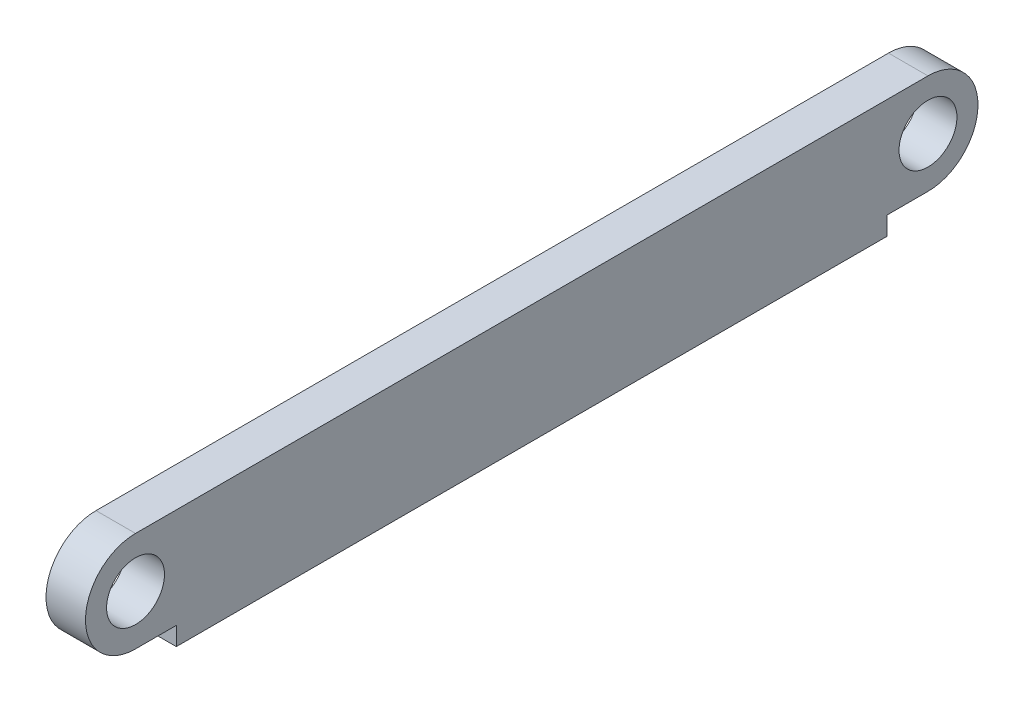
from build123d import *

# Parameters (mm, degrees)
SKETCH2_W           = 54
SKETCH2_H           = 9
BOSS_EXTRUDE1_DEPTH = 3
BOSS_EXTRUDE2_DEPTH = 3
SKETCH4_R           = 2.2
CUT_EXTRUDE1_DEPTH  = 43.860354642
SKETCH5_W           = 52
SKETCH5_H           = 7.5
CUT_EXTRUDE2_DEPTH  = 0.75


with BuildPart() as part:
    # Sketch2 → Boss-Extrude1 (new body)
    with BuildSketch(Plane(origin=(0, 0, 0), x_dir=(0, 0, -1), z_dir=(1, 0, 0))):
        with Locations((8.5, -1)):
            Rectangle(SKETCH2_W, SKETCH2_H)
    extrude(amount=BOSS_EXTRUDE1_DEPTH)

    # Sketch3 → Boss-Extrude2 (add)
    with BuildSketch(Plane(origin=(0, 0, 0), x_dir=(0, 0, -1), z_dir=(1, 0, 0))):
        with BuildLine():
            Line((-21.6, 3.5), (-18.2, 3.5))
            ThreePointArc((-18.2, 3.5), (-14.4, -0.3), (-18.2, -4.1))
            Line((-18.2, -4.1), (-21.6, -4.1))
            ThreePointArc((-21.6, -4.1), (-25.4, -0.3), (-21.6, 3.5))
        make_face()
        with BuildLine():
            Line((35.2, 3.5), (38.6, 3.5))
            ThreePointArc((38.6, 3.5), (42.4, -0.3), (38.6, -4.1))
            Line((38.6, -4.1), (35.2, -4.1))
            ThreePointArc((35.2, -4.1), (31.4, -0.3), (35.2, 3.5))
        make_face()
    extrude(amount=BOSS_EXTRUDE2_DEPTH)

    # Sketch4 → Cut-Extrude1 (cut, through all)
    with BuildSketch(Plane(origin=(3, 0, 0), x_dir=(0, 0, -1), z_dir=(1, 0, 0))):
        with Locations((-21.6, -0.3)):
            Circle(SKETCH4_R)
        with Locations((38.6, -0.3)):
            Circle(SKETCH4_R)
    extrude(amount=-CUT_EXTRUDE1_DEPTH, mode=Mode.SUBTRACT)

    # Sketch5 → Cut-Extrude2 (cut)
    with BuildSketch(Plane.ZY):
        with Locations((-8.5, -1)):
            Rectangle(SKETCH5_W, SKETCH5_H)
    extrude(amount=-CUT_EXTRUDE2_DEPTH, mode=Mode.SUBTRACT)


solid = part.part
